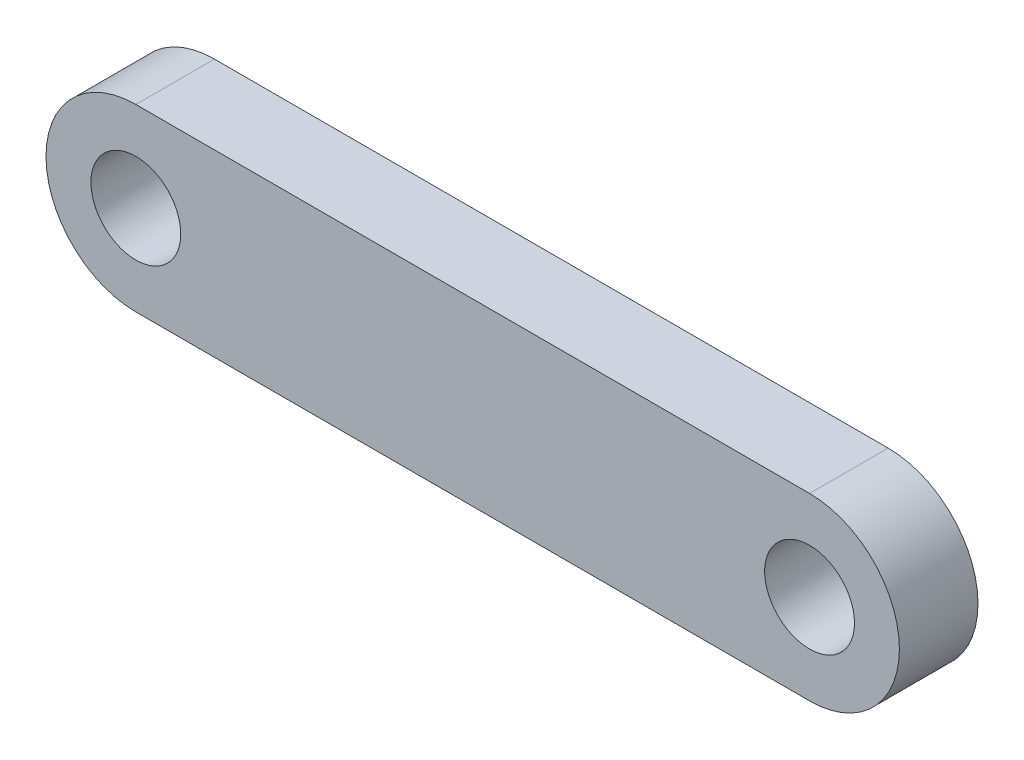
ISO-10303-21;
HEADER;
FILE_DESCRIPTION(('STEP AP214'),'2;1');
FILE_NAME('part.step','',(''),(''),'','','');
FILE_SCHEMA(('AUTOMOTIVE_DESIGN { 1 0 10303 214 1 1 1 1 }'));
ENDSEC;
DATA;
#1=APPLICATION_CONTEXT('core data for automotive mechanical design processes');
#2=APPLICATION_PROTOCOL_DEFINITION('international standard','automotive_design',2000,#1);
#3=PRODUCT_CONTEXT('',#1,'mechanical');
#4=PRODUCT('Part','Part','',(#3));
#5=PRODUCT_RELATED_PRODUCT_CATEGORY('part','',(#4));
#6=PRODUCT_DEFINITION_FORMATION('','',#4);
#7=PRODUCT_DEFINITION_CONTEXT('part definition',#1,'design');
#8=PRODUCT_DEFINITION('design','',#6,#7);
#9=PRODUCT_DEFINITION_SHAPE('','',#8);
#10=(LENGTH_UNIT() NAMED_UNIT(*) SI_UNIT(.MILLI.,.METRE.));
#11=(NAMED_UNIT(*) PLANE_ANGLE_UNIT() SI_UNIT($,.RADIAN.));
#12=(NAMED_UNIT(*) SI_UNIT($,.STERADIAN.) SOLID_ANGLE_UNIT());
#13=UNCERTAINTY_MEASURE_WITH_UNIT(LENGTH_MEASURE(1.E-05),#10,'distance_accuracy_value','');
#14=(GEOMETRIC_REPRESENTATION_CONTEXT(3) GLOBAL_UNCERTAINTY_ASSIGNED_CONTEXT((#13)) GLOBAL_UNIT_ASSIGNED_CONTEXT((#10,
#11,#12)) REPRESENTATION_CONTEXT('',''));
#15=CARTESIAN_POINT('',(0.,0.,0.));
#16=DIRECTION('',(0.,0.,1.));
#17=DIRECTION('',(1.,0.,0.));
#18=AXIS2_PLACEMENT_3D('',#15,#16,#17);
#19=CARTESIAN_POINT('',(75.,0.,17.5));
#20=DIRECTION('',(0.,0.,-1.));
#21=DIRECTION('',(-1.,0.,0.));
#22=AXIS2_PLACEMENT_3D('',#19,#20,#21);
#23=PLANE('',#22);
#24=CARTESIAN_POINT('',(75.,0.,17.5));
#25=DIRECTION('',(0.,0.,1.));
#26=DIRECTION('',(1.,0.,0.));
#27=AXIS2_PLACEMENT_3D('',#24,#25,#26);
#28=CIRCLE('',#27,9.99999999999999);
#29=CARTESIAN_POINT('',(85.,0.,17.5));
#30=VERTEX_POINT('',#29);
#31=EDGE_CURVE('E91',#30,#30,#28,.T.);
#32=ORIENTED_EDGE('',*,*,#31,.F.);
#33=EDGE_LOOP('',(#32));
#34=FACE_BOUND('',#33,.T.);
#35=CARTESIAN_POINT('',(75.,0.,17.5));
#36=DIRECTION('',(0.,0.,1.));
#37=DIRECTION('',(-1.,0.,0.));
#38=AXIS2_PLACEMENT_3D('',#35,#36,#37);
#39=CIRCLE('',#38,20.);
#40=CARTESIAN_POINT('',(75.,-20.,17.5));
#41=VERTEX_POINT('',#40);
#42=CARTESIAN_POINT('',(75.,20.,17.5));
#43=VERTEX_POINT('',#42);
#44=EDGE_CURVE('E101',#41,#43,#39,.T.);
#45=ORIENTED_EDGE('',*,*,#44,.T.);
#46=DIRECTION('',(-1.,0.,0.));
#47=VECTOR('',#46,1.);
#48=CARTESIAN_POINT('',(75.,20.,17.5));
#49=LINE('',#48,#47);
#50=CARTESIAN_POINT('',(-75.,20.,17.5));
#51=VERTEX_POINT('',#50);
#52=EDGE_CURVE('E86',#43,#51,#49,.T.);
#53=ORIENTED_EDGE('',*,*,#52,.T.);
#54=CARTESIAN_POINT('',(-75.,0.,17.5));
#55=DIRECTION('',(0.,0.,1.));
#56=DIRECTION('',(1.,0.,0.));
#57=AXIS2_PLACEMENT_3D('',#54,#55,#56);
#58=CIRCLE('',#57,20.);
#59=CARTESIAN_POINT('',(-75.,-20.,17.5));
#60=VERTEX_POINT('',#59);
#61=EDGE_CURVE('E52',#51,#60,#58,.T.);
#62=ORIENTED_EDGE('',*,*,#61,.T.);
#63=DIRECTION('',(1.,0.,0.));
#64=VECTOR('',#63,1.);
#65=CARTESIAN_POINT('',(75.,-20.,17.5));
#66=LINE('',#65,#64);
#67=EDGE_CURVE('E47',#60,#41,#66,.T.);
#68=ORIENTED_EDGE('',*,*,#67,.T.);
#69=EDGE_LOOP('',(#45,#53,#62,#68));
#70=FACE_BOUND('',#69,.T.);
#71=CARTESIAN_POINT('',(-75.,0.,17.5));
#72=DIRECTION('',(0.,0.,1.));
#73=DIRECTION('',(-1.,0.,0.));
#74=AXIS2_PLACEMENT_3D('',#71,#72,#73);
#75=CIRCLE('',#74,9.99999999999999);
#76=CARTESIAN_POINT('',(-85.,0.,17.5));
#77=VERTEX_POINT('',#76);
#78=EDGE_CURVE('E119',#77,#77,#75,.T.);
#79=ORIENTED_EDGE('',*,*,#78,.F.);
#80=EDGE_LOOP('',(#79));
#81=FACE_BOUND('',#80,.T.);
#82=ADVANCED_FACE('F32',(#34,#70,#81),#23,.F.);
#83=CARTESIAN_POINT('',(75.,0.,0.));
#84=DIRECTION('',(0.,0.,-1.));
#85=DIRECTION('',(-1.,0.,0.));
#86=AXIS2_PLACEMENT_3D('',#83,#84,#85);
#87=PLANE('',#86);
#88=CARTESIAN_POINT('',(75.,0.,0.));
#89=DIRECTION('',(0.,0.,1.));
#90=DIRECTION('',(1.,0.,0.));
#91=AXIS2_PLACEMENT_3D('',#88,#89,#90);
#92=CIRCLE('',#91,9.99999999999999);
#93=CARTESIAN_POINT('',(85.,0.,0.));
#94=VERTEX_POINT('',#93);
#95=EDGE_CURVE('E94',#94,#94,#92,.T.);
#96=ORIENTED_EDGE('',*,*,#95,.T.);
#97=EDGE_LOOP('',(#96));
#98=FACE_BOUND('',#97,.T.);
#99=CARTESIAN_POINT('',(75.,0.,0.));
#100=DIRECTION('',(0.,0.,1.));
#101=DIRECTION('',(-1.,0.,0.));
#102=AXIS2_PLACEMENT_3D('',#99,#100,#101);
#103=CIRCLE('',#102,20.);
#104=CARTESIAN_POINT('',(75.,-20.,0.));
#105=VERTEX_POINT('',#104);
#106=CARTESIAN_POINT('',(75.,20.,0.));
#107=VERTEX_POINT('',#106);
#108=EDGE_CURVE('E78',#105,#107,#103,.T.);
#109=ORIENTED_EDGE('',*,*,#108,.F.);
#110=DIRECTION('',(1.,0.,0.));
#111=VECTOR('',#110,1.);
#112=CARTESIAN_POINT('',(75.,-20.,0.));
#113=LINE('',#112,#111);
#114=CARTESIAN_POINT('',(-75.,-20.,0.));
#115=VERTEX_POINT('',#114);
#116=EDGE_CURVE('E99',#115,#105,#113,.T.);
#117=ORIENTED_EDGE('',*,*,#116,.F.);
#118=CARTESIAN_POINT('',(-75.,0.,0.));
#119=DIRECTION('',(0.,0.,1.));
#120=DIRECTION('',(1.,0.,0.));
#121=AXIS2_PLACEMENT_3D('',#118,#119,#120);
#122=CIRCLE('',#121,20.);
#123=CARTESIAN_POINT('',(-75.,20.,0.));
#124=VERTEX_POINT('',#123);
#125=EDGE_CURVE('E79',#124,#115,#122,.T.);
#126=ORIENTED_EDGE('',*,*,#125,.F.);
#127=DIRECTION('',(-1.,0.,0.));
#128=VECTOR('',#127,1.);
#129=CARTESIAN_POINT('',(75.,20.,0.));
#130=LINE('',#129,#128);
#131=EDGE_CURVE('E73',#107,#124,#130,.T.);
#132=ORIENTED_EDGE('',*,*,#131,.F.);
#133=EDGE_LOOP('',(#109,#117,#126,#132));
#134=FACE_BOUND('',#133,.T.);
#135=CARTESIAN_POINT('',(-75.,0.,0.));
#136=DIRECTION('',(0.,0.,1.));
#137=DIRECTION('',(-1.,0.,0.));
#138=AXIS2_PLACEMENT_3D('',#135,#136,#137);
#139=CIRCLE('',#138,9.99999999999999);
#140=CARTESIAN_POINT('',(-85.,0.,0.));
#141=VERTEX_POINT('',#140);
#142=EDGE_CURVE('E121',#141,#141,#139,.T.);
#143=ORIENTED_EDGE('',*,*,#142,.T.);
#144=EDGE_LOOP('',(#143));
#145=FACE_BOUND('',#144,.T.);
#146=ADVANCED_FACE('F74',(#98,#134,#145),#87,.T.);
#147=CARTESIAN_POINT('',(75.,0.,17.5));
#148=DIRECTION('',(0.,0.,-1.));
#149=DIRECTION('',(-1.,0.,0.));
#150=AXIS2_PLACEMENT_3D('',#147,#148,#149);
#151=CYLINDRICAL_SURFACE('',#150,20.);
#152=ORIENTED_EDGE('',*,*,#108,.T.);
#153=DIRECTION('',(0.,0.,-1.));
#154=VECTOR('',#153,1.);
#155=CARTESIAN_POINT('',(75.,20.,17.5));
#156=LINE('',#155,#154);
#157=EDGE_CURVE('E11',#43,#107,#156,.T.);
#158=ORIENTED_EDGE('',*,*,#157,.F.);
#159=ORIENTED_EDGE('',*,*,#44,.F.);
#160=DIRECTION('',(0.,0.,-1.));
#161=VECTOR('',#160,1.);
#162=CARTESIAN_POINT('',(75.,-20.,17.5));
#163=LINE('',#162,#161);
#164=EDGE_CURVE('E90',#41,#105,#163,.T.);
#165=ORIENTED_EDGE('',*,*,#164,.T.);
#166=EDGE_LOOP('',(#152,#158,#159,#165));
#167=FACE_BOUND('',#166,.T.);
#168=ADVANCED_FACE('F34',(#167),#151,.T.);
#169=CARTESIAN_POINT('',(75.,20.,17.5));
#170=DIRECTION('',(0.,-1.,0.));
#171=DIRECTION('',(1.,0.,0.));
#172=AXIS2_PLACEMENT_3D('',#169,#170,#171);
#173=PLANE('',#172);
#174=ORIENTED_EDGE('',*,*,#131,.T.);
#175=DIRECTION('',(0.,0.,-1.));
#176=VECTOR('',#175,1.);
#177=CARTESIAN_POINT('',(-75.,20.,17.5));
#178=LINE('',#177,#176);
#179=EDGE_CURVE('E40',#51,#124,#178,.T.);
#180=ORIENTED_EDGE('',*,*,#179,.F.);
#181=ORIENTED_EDGE('',*,*,#52,.F.);
#182=ORIENTED_EDGE('',*,*,#157,.T.);
#183=EDGE_LOOP('',(#174,#180,#181,#182));
#184=FACE_BOUND('',#183,.T.);
#185=ADVANCED_FACE('F85',(#184),#173,.F.);
#186=CARTESIAN_POINT('',(-75.,0.,17.5));
#187=DIRECTION('',(0.,0.,-1.));
#188=DIRECTION('',(-1.,0.,0.));
#189=AXIS2_PLACEMENT_3D('',#186,#187,#188);
#190=CYLINDRICAL_SURFACE('',#189,20.);
#191=ORIENTED_EDGE('',*,*,#125,.T.);
#192=DIRECTION('',(0.,0.,-1.));
#193=VECTOR('',#192,1.);
#194=CARTESIAN_POINT('',(-75.,-20.,17.5));
#195=LINE('',#194,#193);
#196=EDGE_CURVE('E107',#60,#115,#195,.T.);
#197=ORIENTED_EDGE('',*,*,#196,.F.);
#198=ORIENTED_EDGE('',*,*,#61,.F.);
#199=ORIENTED_EDGE('',*,*,#179,.T.);
#200=EDGE_LOOP('',(#191,#197,#198,#199));
#201=FACE_BOUND('',#200,.T.);
#202=ADVANCED_FACE('F110',(#201),#190,.T.);
#203=CARTESIAN_POINT('',(75.,-20.,17.5));
#204=DIRECTION('',(0.,1.,0.));
#205=DIRECTION('',(-1.,0.,0.));
#206=AXIS2_PLACEMENT_3D('',#203,#204,#205);
#207=PLANE('',#206);
#208=ORIENTED_EDGE('',*,*,#116,.T.);
#209=ORIENTED_EDGE('',*,*,#164,.F.);
#210=ORIENTED_EDGE('',*,*,#67,.F.);
#211=ORIENTED_EDGE('',*,*,#196,.T.);
#212=EDGE_LOOP('',(#208,#209,#210,#211));
#213=FACE_BOUND('',#212,.T.);
#214=ADVANCED_FACE('F112',(#213),#207,.F.);
#215=CARTESIAN_POINT('',(75.,0.,17.5));
#216=DIRECTION('',(0.,0.,-1.));
#217=DIRECTION('',(-1.,0.,0.));
#218=AXIS2_PLACEMENT_3D('',#215,#216,#217);
#219=CYLINDRICAL_SURFACE('',#218,9.99999999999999);
#220=ORIENTED_EDGE('',*,*,#31,.T.);
#221=EDGE_LOOP('',(#220));
#222=FACE_BOUND('',#221,.T.);
#223=ORIENTED_EDGE('',*,*,#95,.F.);
#224=EDGE_LOOP('',(#223));
#225=FACE_BOUND('',#224,.T.);
#226=ADVANCED_FACE('F130',(#222,#225),#219,.F.);
#227=CARTESIAN_POINT('',(-75.,0.,17.5));
#228=DIRECTION('',(0.,0.,-1.));
#229=DIRECTION('',(-1.,0.,0.));
#230=AXIS2_PLACEMENT_3D('',#227,#228,#229);
#231=CYLINDRICAL_SURFACE('',#230,9.99999999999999);
#232=ORIENTED_EDGE('',*,*,#78,.T.);
#233=EDGE_LOOP('',(#232));
#234=FACE_BOUND('',#233,.T.);
#235=ORIENTED_EDGE('',*,*,#142,.F.);
#236=EDGE_LOOP('',(#235));
#237=FACE_BOUND('',#236,.T.);
#238=ADVANCED_FACE('F128',(#234,#237),#231,.F.);
#239=CLOSED_SHELL('',(#82,#146,#168,#185,#202,#214,#226,#238));
#240=MANIFOLD_SOLID_BREP('B2',#239);
#241=ADVANCED_BREP_SHAPE_REPRESENTATION('',(#18,#240),#14);
#242=SHAPE_DEFINITION_REPRESENTATION(#9,#241);
ENDSEC;
END-ISO-10303-21;
